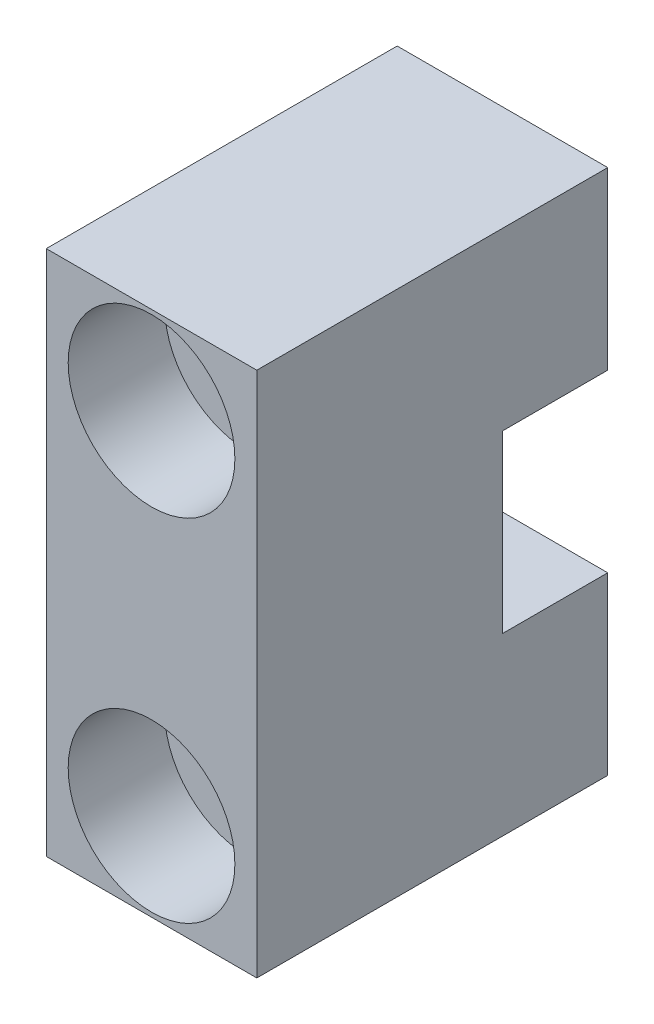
from build123d import *

# Parameters (mm, degrees)
SKETCH_1_W          = 12
SKETCH_1_H          = 30
SKETCH_1_R          = 2.75
EXTRUDE_1_DEPTH     = 20
SKETCH_2_W          = 10.682198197
SKETCH_2_H          = 10
CUT_EXTRUDE_1_DEPTH = 20
SKETCH_3_R          = 4.75
CUT_EXTRUDE_2_DEPTH = 5.5


with BuildPart() as part:
    # Sketch 1 → Extrude 1 (new body)
    with BuildSketch(Plane.XY):
        with Locations((6, -15)):
            Rectangle(SKETCH_1_W, SKETCH_1_H)
        with Locations((6, -25)):
            Circle(SKETCH_1_R, mode=Mode.SUBTRACT)
        with Locations((6, -5)):
            Circle(SKETCH_1_R, mode=Mode.SUBTRACT)
    extrude(amount=EXTRUDE_1_DEPTH)

    # Sketch 2 → Cut-Extrude 1 (cut)
    with BuildSketch(Plane(origin=(12, 0, 0), x_dir=(0, 0, -1), z_dir=(1, 0, 0))):
        with Locations((-0.658900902, -15)):
            Rectangle(SKETCH_2_W, SKETCH_2_H)
    extrude(amount=-CUT_EXTRUDE_1_DEPTH, mode=Mode.SUBTRACT)

    # Sketch 3 → Cut-Extrude 2 (cut)
    with BuildSketch(Plane.XY.offset(20)):
        with Locations((6, -25)):
            Circle(SKETCH_3_R)
        with Locations((6, -5)):
            Circle(SKETCH_3_R)
    extrude(amount=-CUT_EXTRUDE_2_DEPTH, mode=Mode.SUBTRACT)


solid = part.part
